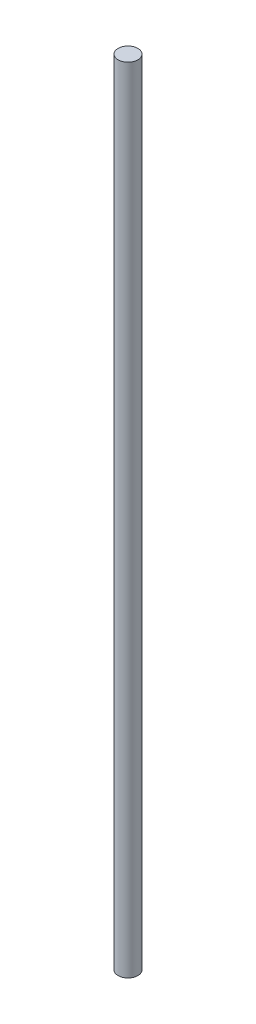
ISO-10303-21;
HEADER;
FILE_DESCRIPTION(('STEP AP214'),'2;1');
FILE_NAME('part.step','',(''),(''),'','','');
FILE_SCHEMA(('AUTOMOTIVE_DESIGN { 1 0 10303 214 1 1 1 1 }'));
ENDSEC;
DATA;
#1=APPLICATION_CONTEXT('core data for automotive mechanical design processes');
#2=APPLICATION_PROTOCOL_DEFINITION('international standard','automotive_design',2000,#1);
#3=PRODUCT_CONTEXT('',#1,'mechanical');
#4=PRODUCT('Part','Part','',(#3));
#5=PRODUCT_RELATED_PRODUCT_CATEGORY('part','',(#4));
#6=PRODUCT_DEFINITION_FORMATION('','',#4);
#7=PRODUCT_DEFINITION_CONTEXT('part definition',#1,'design');
#8=PRODUCT_DEFINITION('design','',#6,#7);
#9=PRODUCT_DEFINITION_SHAPE('','',#8);
#10=(LENGTH_UNIT() NAMED_UNIT(*) SI_UNIT(.MILLI.,.METRE.));
#11=(NAMED_UNIT(*) PLANE_ANGLE_UNIT() SI_UNIT($,.RADIAN.));
#12=(NAMED_UNIT(*) SI_UNIT($,.STERADIAN.) SOLID_ANGLE_UNIT());
#13=UNCERTAINTY_MEASURE_WITH_UNIT(LENGTH_MEASURE(1.E-05),#10,'distance_accuracy_value','');
#14=(GEOMETRIC_REPRESENTATION_CONTEXT(3) GLOBAL_UNCERTAINTY_ASSIGNED_CONTEXT((#13)) GLOBAL_UNIT_ASSIGNED_CONTEXT((#10,
#11,#12)) REPRESENTATION_CONTEXT('',''));
#15=CARTESIAN_POINT('',(0.,0.,0.));
#16=DIRECTION('',(0.,0.,1.));
#17=DIRECTION('',(1.,0.,0.));
#18=AXIS2_PLACEMENT_3D('',#15,#16,#17);
#19=CARTESIAN_POINT('',(21.,399.99995,25.0999999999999));
#20=DIRECTION('',(0.,1.,0.));
#21=DIRECTION('',(0.,0.,1.));
#22=AXIS2_PLACEMENT_3D('',#19,#20,#21);
#23=PLANE('',#22);
#24=CARTESIAN_POINT('',(21.,399.99995,25.0999999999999));
#25=DIRECTION('',(0.,1.,0.));
#26=DIRECTION('',(0.,0.,1.));
#27=AXIS2_PLACEMENT_3D('',#24,#25,#26);
#28=CIRCLE('',#27,5.);
#29=CARTESIAN_POINT('',(21.,399.99995,30.0999999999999));
#30=VERTEX_POINT('',#29);
#31=EDGE_CURVE('E18',#30,#30,#28,.F.);
#32=ORIENTED_EDGE('',*,*,#31,.F.);
#33=EDGE_LOOP('',(#32));
#34=FACE_BOUND('',#33,.T.);
#35=ADVANCED_FACE('F15',(#34),#23,.T.);
#36=CARTESIAN_POINT('',(21.,5.E-05,25.1));
#37=DIRECTION('',(0.,-1.,0.));
#38=DIRECTION('',(0.,0.,-1.));
#39=AXIS2_PLACEMENT_3D('',#36,#37,#38);
#40=PLANE('',#39);
#41=CARTESIAN_POINT('',(21.,4.99999999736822E-05,25.1));
#42=DIRECTION('',(0.,1.,0.));
#43=DIRECTION('',(0.,0.,1.));
#44=AXIS2_PLACEMENT_3D('',#41,#42,#43);
#45=CIRCLE('',#44,5.);
#46=CARTESIAN_POINT('',(21.,4.99999999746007E-05,30.1));
#47=VERTEX_POINT('',#46);
#48=EDGE_CURVE('E10',#47,#47,#45,.T.);
#49=ORIENTED_EDGE('',*,*,#48,.F.);
#50=EDGE_LOOP('',(#49));
#51=FACE_BOUND('',#50,.T.);
#52=ADVANCED_FACE('F30',(#51),#40,.T.);
#53=CARTESIAN_POINT('',(21.,200.,25.1));
#54=DIRECTION('',(0.,1.,0.));
#55=DIRECTION('',(0.,0.,1.));
#56=AXIS2_PLACEMENT_3D('',#53,#54,#55);
#57=CYLINDRICAL_SURFACE('',#56,5.);
#58=ORIENTED_EDGE('',*,*,#31,.T.);
#59=EDGE_LOOP('',(#58));
#60=FACE_BOUND('',#59,.T.);
#61=ORIENTED_EDGE('',*,*,#48,.T.);
#62=EDGE_LOOP('',(#61));
#63=FACE_BOUND('',#62,.T.);
#64=ADVANCED_FACE('F27',(#60,#63),#57,.T.);
#65=CLOSED_SHELL('',(#35,#52,#64));
#66=MANIFOLD_SOLID_BREP('B1',#65);
#67=ADVANCED_BREP_SHAPE_REPRESENTATION('',(#18,#66),#14);
#68=SHAPE_DEFINITION_REPRESENTATION(#9,#67);
ENDSEC;
END-ISO-10303-21;
